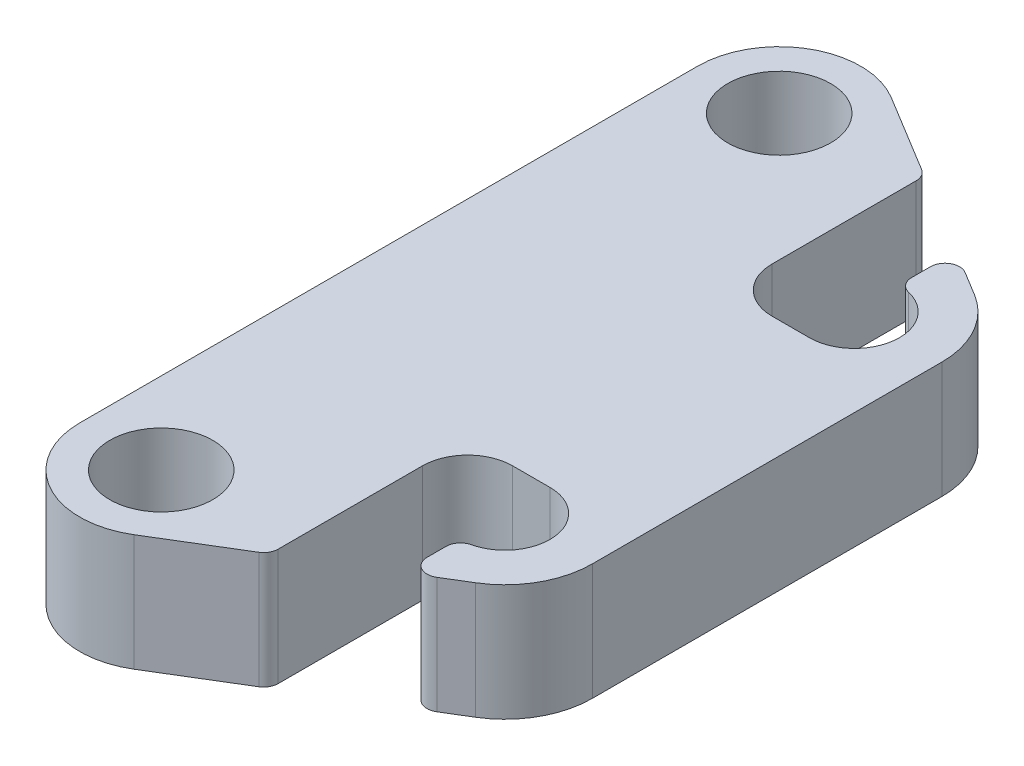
ISO-10303-21;
HEADER;
FILE_DESCRIPTION(('STEP AP214'),'2;1');
FILE_NAME('part.step','',(''),(''),'','','');
FILE_SCHEMA(('AUTOMOTIVE_DESIGN { 1 0 10303 214 1 1 1 1 }'));
ENDSEC;
DATA;
#1=APPLICATION_CONTEXT('core data for automotive mechanical design processes');
#2=APPLICATION_PROTOCOL_DEFINITION('international standard','automotive_design',2000,#1);
#3=PRODUCT_CONTEXT('',#1,'mechanical');
#4=PRODUCT('Part','Part','',(#3));
#5=PRODUCT_RELATED_PRODUCT_CATEGORY('part','',(#4));
#6=PRODUCT_DEFINITION_FORMATION('','',#4);
#7=PRODUCT_DEFINITION_CONTEXT('part definition',#1,'design');
#8=PRODUCT_DEFINITION('design','',#6,#7);
#9=PRODUCT_DEFINITION_SHAPE('','',#8);
#10=(LENGTH_UNIT() NAMED_UNIT(*) SI_UNIT(.MILLI.,.METRE.));
#11=(NAMED_UNIT(*) PLANE_ANGLE_UNIT() SI_UNIT($,.RADIAN.));
#12=(NAMED_UNIT(*) SI_UNIT($,.STERADIAN.) SOLID_ANGLE_UNIT());
#13=UNCERTAINTY_MEASURE_WITH_UNIT(LENGTH_MEASURE(1.E-05),#10,'distance_accuracy_value','');
#14=(GEOMETRIC_REPRESENTATION_CONTEXT(3) GLOBAL_UNCERTAINTY_ASSIGNED_CONTEXT((#13)) GLOBAL_UNIT_ASSIGNED_CONTEXT((#10,
#11,#12)) REPRESENTATION_CONTEXT('',''));
#15=CARTESIAN_POINT('',(0.,0.,0.));
#16=DIRECTION('',(0.,0.,1.));
#17=DIRECTION('',(1.,0.,0.));
#18=AXIS2_PLACEMENT_3D('',#15,#16,#17);
#19=CARTESIAN_POINT('',(2.30969157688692,6.35,-20.6380085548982));
#20=DIRECTION('',(-0.519615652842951,0.,0.854400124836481));
#21=DIRECTION('',(0.854400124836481,0.,0.519615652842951));
#22=AXIS2_PLACEMENT_3D('',#19,#20,#21);
#23=PLANE('',#22);
#24=DIRECTION('',(-0.854400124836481,0.,-0.519615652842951));
#25=VECTOR('',#24,1.);
#26=CARTESIAN_POINT('',(2.30969157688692,6.35,-20.6380085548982));
#27=LINE('',#26,#25);
#28=CARTESIAN_POINT('',(6.54019492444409,6.35,-18.0651674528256));
#29=VERTEX_POINT('',#28);
#30=CARTESIAN_POINT('',(2.30969157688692,6.35,-20.6380085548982));
#31=VERTEX_POINT('',#30);
#32=EDGE_CURVE('E308',#29,#31,#27,.T.);
#33=ORIENTED_EDGE('',*,*,#32,.F.);
#34=DIRECTION('',(0.,1.,0.));
#35=VECTOR('',#34,1.);
#36=CARTESIAN_POINT('',(6.54019492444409,0.,-18.0651674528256));
#37=LINE('',#36,#35);
#38=CARTESIAN_POINT('',(6.54019492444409,0.,-18.0651674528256));
#39=VERTEX_POINT('',#38);
#40=EDGE_CURVE('E11',#29,#39,#37,.F.);
#41=ORIENTED_EDGE('',*,*,#40,.T.);
#42=DIRECTION('',(-0.854400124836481,0.,-0.519615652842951));
#43=VECTOR('',#42,1.);
#44=CARTESIAN_POINT('',(2.30969157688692,0.,-20.6380085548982));
#45=LINE('',#44,#43);
#46=CARTESIAN_POINT('',(2.30969157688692,0.,-20.6380085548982));
#47=VERTEX_POINT('',#46);
#48=EDGE_CURVE('E330',#39,#47,#45,.T.);
#49=ORIENTED_EDGE('',*,*,#48,.T.);
#50=DIRECTION('',(0.,-1.,0.));
#51=VECTOR('',#50,1.);
#52=CARTESIAN_POINT('',(2.30969157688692,6.35,-20.6380085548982));
#53=LINE('',#52,#51);
#54=EDGE_CURVE('E364',#31,#47,#53,.T.);
#55=ORIENTED_EDGE('',*,*,#54,.F.);
#56=EDGE_LOOP('',(#33,#41,#49,#55));
#57=FACE_BOUND('',#56,.T.);
#58=ADVANCED_FACE('F40',(#57),#23,.F.);
#59=CARTESIAN_POINT('',(13.8919695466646,0.,-13.5940805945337));
#60=VERTEX_POINT('',#59);
#61=CARTESIAN_POINT('',(12.5726949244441,0.,-14.396416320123));
#62=VERTEX_POINT('',#61);
#63=EDGE_CURVE('E331',#60,#62,#45,.T.);
#64=ORIENTED_EDGE('',*,*,#63,.T.);
#65=DIRECTION('',(0.,1.,0.));
#66=VECTOR('',#65,1.);
#67=CARTESIAN_POINT('',(12.5726949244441,6.35,-14.396416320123));
#68=LINE('',#67,#66);
#69=CARTESIAN_POINT('',(12.5726949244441,6.35,-14.396416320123));
#70=VERTEX_POINT('',#69);
#71=EDGE_CURVE('E414',#62,#70,#68,.T.);
#72=ORIENTED_EDGE('',*,*,#71,.T.);
#73=CARTESIAN_POINT('',(13.8919695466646,6.35,-13.5940805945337));
#74=VERTEX_POINT('',#73);
#75=EDGE_CURVE('E310',#74,#70,#27,.T.);
#76=ORIENTED_EDGE('',*,*,#75,.F.);
#77=DIRECTION('',(0.,-1.,0.));
#78=VECTOR('',#77,1.);
#79=CARTESIAN_POINT('',(13.8919695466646,6.35,-13.5940805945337));
#80=LINE('',#79,#78);
#81=EDGE_CURVE('E367',#74,#60,#80,.T.);
#82=ORIENTED_EDGE('',*,*,#81,.T.);
#83=EDGE_LOOP('',(#64,#72,#76,#82));
#84=FACE_BOUND('',#83,.T.);
#85=ADVANCED_FACE('F439',(#84),#23,.F.);
#86=CARTESIAN_POINT('',(2.30969157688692,6.35,20.6380085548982));
#87=DIRECTION('',(-0.519615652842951,0.,-0.854400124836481));
#88=DIRECTION('',(-0.854400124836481,0.,0.519615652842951));
#89=AXIS2_PLACEMENT_3D('',#86,#87,#88);
#90=PLANE('',#89);
#91=DIRECTION('',(0.854400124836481,0.,-0.519615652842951));
#92=VECTOR('',#91,1.);
#93=CARTESIAN_POINT('',(2.30969157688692,6.35,20.6380085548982));
#94=LINE('',#93,#92);
#95=CARTESIAN_POINT('',(12.5726949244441,6.35,14.396416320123));
#96=VERTEX_POINT('',#95);
#97=CARTESIAN_POINT('',(13.8919695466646,6.35,13.5940805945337));
#98=VERTEX_POINT('',#97);
#99=EDGE_CURVE('E319',#96,#98,#94,.T.);
#100=ORIENTED_EDGE('',*,*,#99,.F.);
#101=DIRECTION('',(0.,1.,0.));
#102=VECTOR('',#101,1.);
#103=CARTESIAN_POINT('',(12.5726949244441,0.,14.396416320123));
#104=LINE('',#103,#102);
#105=CARTESIAN_POINT('',(12.5726949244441,0.,14.396416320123));
#106=VERTEX_POINT('',#105);
#107=EDGE_CURVE('E403',#96,#106,#104,.F.);
#108=ORIENTED_EDGE('',*,*,#107,.T.);
#109=DIRECTION('',(0.854400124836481,0.,-0.519615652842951));
#110=VECTOR('',#109,1.);
#111=CARTESIAN_POINT('',(2.30969157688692,0.,20.6380085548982));
#112=LINE('',#111,#110);
#113=CARTESIAN_POINT('',(13.8919695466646,0.,13.5940805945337));
#114=VERTEX_POINT('',#113);
#115=EDGE_CURVE('E340',#106,#114,#112,.T.);
#116=ORIENTED_EDGE('',*,*,#115,.T.);
#117=DIRECTION('',(0.,-1.,0.));
#118=VECTOR('',#117,1.);
#119=CARTESIAN_POINT('',(13.8919695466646,6.35,13.5940805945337));
#120=LINE('',#119,#118);
#121=EDGE_CURVE('E352',#98,#114,#120,.T.);
#122=ORIENTED_EDGE('',*,*,#121,.F.);
#123=EDGE_LOOP('',(#100,#108,#116,#122));
#124=FACE_BOUND('',#123,.T.);
#125=ADVANCED_FACE('F528',(#124),#90,.F.);
#126=CARTESIAN_POINT('',(2.30969157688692,0.,20.6380085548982));
#127=VERTEX_POINT('',#126);
#128=CARTESIAN_POINT('',(6.54019492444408,0.,18.0651674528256));
#129=VERTEX_POINT('',#128);
#130=EDGE_CURVE('E341',#127,#129,#112,.T.);
#131=ORIENTED_EDGE('',*,*,#130,.T.);
#132=DIRECTION('',(0.,1.,0.));
#133=VECTOR('',#132,1.);
#134=CARTESIAN_POINT('',(6.54019492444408,6.35,18.0651674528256));
#135=LINE('',#134,#133);
#136=CARTESIAN_POINT('',(6.54019492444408,6.35,18.0651674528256));
#137=VERTEX_POINT('',#136);
#138=EDGE_CURVE('E370',#129,#137,#135,.T.);
#139=ORIENTED_EDGE('',*,*,#138,.T.);
#140=CARTESIAN_POINT('',(2.30969157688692,6.35,20.6380085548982));
#141=VERTEX_POINT('',#140);
#142=EDGE_CURVE('E320',#141,#137,#94,.T.);
#143=ORIENTED_EDGE('',*,*,#142,.F.);
#144=DIRECTION('',(0.,-1.,0.));
#145=VECTOR('',#144,1.);
#146=CARTESIAN_POINT('',(2.30969157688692,6.35,20.6380085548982));
#147=LINE('',#146,#145);
#148=EDGE_CURVE('E355',#141,#127,#147,.T.);
#149=ORIENTED_EDGE('',*,*,#148,.T.);
#150=EDGE_LOOP('',(#131,#139,#143,#149));
#151=FACE_BOUND('',#150,.T.);
#152=ADVANCED_FACE('F499',(#151),#90,.F.);
#153=CARTESIAN_POINT('',(11.4173,6.35,-9.525));
#154=DIRECTION('',(0.,1.,0.));
#155=DIRECTION('',(0.,0.,1.));
#156=AXIS2_PLACEMENT_3D('',#153,#154,#155);
#157=PLANE('',#156);
#158=CARTESIAN_POINT('',(0.,6.35,16.8402));
#159=DIRECTION('',(0.,-1.,0.));
#160=DIRECTION('',(0.,0.,-1.));
#161=AXIS2_PLACEMENT_3D('',#158,#159,#160);
#162=CIRCLE('',#161,2.8067);
#163=CARTESIAN_POINT('',(0.,6.35,14.0335));
#164=VERTEX_POINT('',#163);
#165=EDGE_CURVE('E295',#164,#164,#162,.T.);
#166=ORIENTED_EDGE('',*,*,#165,.T.);
#167=EDGE_LOOP('',(#166));
#168=FACE_BOUND('',#167,.T.);
#169=CARTESIAN_POINT('',(0.,6.35,-16.8402));
#170=DIRECTION('',(0.,-1.,0.));
#171=DIRECTION('',(0.,0.,-1.));
#172=AXIS2_PLACEMENT_3D('',#169,#170,#171);
#173=CIRCLE('',#172,2.8067);
#174=CARTESIAN_POINT('',(0.,6.35,-19.6469));
#175=VERTEX_POINT('',#174);
#176=EDGE_CURVE('E301',#175,#175,#173,.T.);
#177=ORIENTED_EDGE('',*,*,#176,.T.);
#178=EDGE_LOOP('',(#177));
#179=FACE_BOUND('',#178,.T.);
#180=ORIENTED_EDGE('',*,*,#142,.T.);
#181=CARTESIAN_POINT('',(6.12774999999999,6.35,17.3869873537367));
#182=DIRECTION('',(0.,1.,0.));
#183=DIRECTION('',(0.,0.,1.));
#184=AXIS2_PLACEMENT_3D('',#181,#182,#183);
#185=CIRCLE('',#184,0.79375);
#186=CARTESIAN_POINT('',(6.92149999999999,6.35,17.3869873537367));
#187=VERTEX_POINT('',#186);
#188=EDGE_CURVE('E383',#137,#187,#185,.T.);
#189=ORIENTED_EDGE('',*,*,#188,.T.);
#190=DIRECTION('',(0.,0.,-1.));
#191=VECTOR('',#190,1.);
#192=CARTESIAN_POINT('',(6.92149999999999,6.35,9.525));
#193=LINE('',#192,#191);
#194=CARTESIAN_POINT('',(6.92149999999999,6.35,9.525));
#195=VERTEX_POINT('',#194);
#196=EDGE_CURVE('E271',#187,#195,#193,.T.);
#197=ORIENTED_EDGE('',*,*,#196,.T.);
#198=CARTESIAN_POINT('',(9.37894999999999,6.35,9.525));
#199=DIRECTION('',(0.,-1.,0.));
#200=DIRECTION('',(0.,0.,1.));
#201=AXIS2_PLACEMENT_3D('',#198,#199,#200);
#202=CIRCLE('',#201,2.45745);
#203=CARTESIAN_POINT('',(9.37894999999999,6.35,7.06755));
#204=VERTEX_POINT('',#203);
#205=EDGE_CURVE('E273',#195,#204,#202,.T.);
#206=ORIENTED_EDGE('',*,*,#205,.T.);
#207=DIRECTION('',(1.,0.,0.));
#208=VECTOR('',#207,1.);
#209=CARTESIAN_POINT('',(11.4173,6.35,7.06755));
#210=LINE('',#209,#208);
#211=CARTESIAN_POINT('',(11.4173,6.35,7.06755));
#212=VERTEX_POINT('',#211);
#213=EDGE_CURVE('E261',#204,#212,#210,.T.);
#214=ORIENTED_EDGE('',*,*,#213,.T.);
#215=CARTESIAN_POINT('',(11.4173,6.35,9.525));
#216=DIRECTION('',(0.,-1.,0.));
#217=DIRECTION('',(0.,0.,-1.));
#218=AXIS2_PLACEMENT_3D('',#215,#216,#217);
#219=CIRCLE('',#218,2.45745);
#220=CARTESIAN_POINT('',(11.9788657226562,6.35,11.9174264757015));
#221=VERTEX_POINT('',#220);
#222=EDGE_CURVE('E285',#212,#221,#219,.T.);
#223=ORIENTED_EDGE('',*,*,#222,.T.);
#224=CARTESIAN_POINT('',(12.16025,6.35,12.6901740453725));
#225=DIRECTION('',(0.,1.,0.));
#226=DIRECTION('',(0.,0.,1.));
#227=AXIS2_PLACEMENT_3D('',#224,#225,#226);
#228=CIRCLE('',#227,0.79375);
#229=CARTESIAN_POINT('',(11.3665,6.35,12.6901740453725));
#230=VERTEX_POINT('',#229);
#231=EDGE_CURVE('E379',#221,#230,#228,.T.);
#232=ORIENTED_EDGE('',*,*,#231,.T.);
#233=DIRECTION('',(0.,0.,1.));
#234=VECTOR('',#233,1.);
#235=CARTESIAN_POINT('',(11.3665,6.35,11.98245));
#236=LINE('',#235,#234);
#237=CARTESIAN_POINT('',(11.3665,6.35,13.718236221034));
#238=VERTEX_POINT('',#237);
#239=EDGE_CURVE('E268',#230,#238,#236,.T.);
#240=ORIENTED_EDGE('',*,*,#239,.T.);
#241=CARTESIAN_POINT('',(12.16025,6.35,13.718236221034));
#242=DIRECTION('',(0.,1.,0.));
#243=DIRECTION('',(0.,0.,1.));
#244=AXIS2_PLACEMENT_3D('',#241,#242,#243);
#245=CIRCLE('',#244,0.79375);
#246=EDGE_CURVE('E381',#238,#96,#245,.T.);
#247=ORIENTED_EDGE('',*,*,#246,.T.);
#248=ORIENTED_EDGE('',*,*,#99,.T.);
#249=CARTESIAN_POINT('',(11.4173,6.35,9.525));
#250=DIRECTION('',(0.,1.,0.));
#251=DIRECTION('',(0.,0.,-1.));
#252=AXIS2_PLACEMENT_3D('',#249,#250,#251);
#253=CIRCLE('',#252,4.7625);
#254=CARTESIAN_POINT('',(16.1798,6.35,9.525));
#255=VERTEX_POINT('',#254);
#256=EDGE_CURVE('E323',#98,#255,#253,.T.);
#257=ORIENTED_EDGE('',*,*,#256,.T.);
#258=DIRECTION('',(0.,0.,-1.));
#259=VECTOR('',#258,1.);
#260=CARTESIAN_POINT('',(16.1798,6.35,-9.525));
#261=LINE('',#260,#259);
#262=CARTESIAN_POINT('',(16.1798,6.35,-9.525));
#263=VERTEX_POINT('',#262);
#264=EDGE_CURVE('E325',#255,#263,#261,.T.);
#265=ORIENTED_EDGE('',*,*,#264,.T.);
#266=CARTESIAN_POINT('',(11.4173,6.35,-9.525));
#267=DIRECTION('',(0.,1.,0.));
#268=DIRECTION('',(0.,0.,1.));
#269=AXIS2_PLACEMENT_3D('',#266,#267,#268);
#270=CIRCLE('',#269,4.7625);
#271=EDGE_CURVE('E305',#263,#74,#270,.T.);
#272=ORIENTED_EDGE('',*,*,#271,.T.);
#273=ORIENTED_EDGE('',*,*,#75,.T.);
#274=CARTESIAN_POINT('',(12.16025,6.35,-13.718236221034));
#275=DIRECTION('',(0.,1.,0.));
#276=DIRECTION('',(0.,0.,1.));
#277=AXIS2_PLACEMENT_3D('',#274,#275,#276);
#278=CIRCLE('',#277,0.79375);
#279=CARTESIAN_POINT('',(11.3665,6.35,-13.718236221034));
#280=VERTEX_POINT('',#279);
#281=EDGE_CURVE('E375',#70,#280,#278,.T.);
#282=ORIENTED_EDGE('',*,*,#281,.T.);
#283=DIRECTION('',(0.,0.,1.));
#284=VECTOR('',#283,1.);
#285=CARTESIAN_POINT('',(11.3665,6.35,-11.98245));
#286=LINE('',#285,#284);
#287=CARTESIAN_POINT('',(11.3665,6.35,-12.6901740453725));
#288=VERTEX_POINT('',#287);
#289=EDGE_CURVE('E249',#280,#288,#286,.T.);
#290=ORIENTED_EDGE('',*,*,#289,.T.);
#291=CARTESIAN_POINT('',(12.16025,6.35,-12.6901740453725));
#292=DIRECTION('',(0.,1.,0.));
#293=DIRECTION('',(0.,0.,1.));
#294=AXIS2_PLACEMENT_3D('',#291,#292,#293);
#295=CIRCLE('',#294,0.79375);
#296=CARTESIAN_POINT('',(11.9788657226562,6.35,-11.9174264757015));
#297=VERTEX_POINT('',#296);
#298=EDGE_CURVE('E377',#288,#297,#295,.T.);
#299=ORIENTED_EDGE('',*,*,#298,.T.);
#300=CARTESIAN_POINT('',(11.4173,6.35,-9.525));
#301=DIRECTION('',(0.,-1.,0.));
#302=DIRECTION('',(0.,0.,-1.));
#303=AXIS2_PLACEMENT_3D('',#300,#301,#302);
#304=CIRCLE('',#303,2.45745);
#305=CARTESIAN_POINT('',(11.4173,6.35,-7.06755));
#306=VERTEX_POINT('',#305);
#307=EDGE_CURVE('E290',#297,#306,#304,.T.);
#308=ORIENTED_EDGE('',*,*,#307,.T.);
#309=DIRECTION('',(-1.,0.,0.));
#310=VECTOR('',#309,1.);
#311=CARTESIAN_POINT('',(11.4173,6.35,-7.06755));
#312=LINE('',#311,#310);
#313=CARTESIAN_POINT('',(9.37894999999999,6.35,-7.06755));
#314=VERTEX_POINT('',#313);
#315=EDGE_CURVE('E225',#306,#314,#312,.T.);
#316=ORIENTED_EDGE('',*,*,#315,.T.);
#317=CARTESIAN_POINT('',(9.37894999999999,6.35,-9.525));
#318=DIRECTION('',(0.,-1.,0.));
#319=DIRECTION('',(0.,0.,-1.));
#320=AXIS2_PLACEMENT_3D('',#317,#318,#319);
#321=CIRCLE('',#320,2.45745);
#322=CARTESIAN_POINT('',(6.92149999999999,6.35,-9.525));
#323=VERTEX_POINT('',#322);
#324=EDGE_CURVE('E245',#314,#323,#321,.T.);
#325=ORIENTED_EDGE('',*,*,#324,.T.);
#326=DIRECTION('',(0.,0.,-1.));
#327=VECTOR('',#326,1.);
#328=CARTESIAN_POINT('',(6.92149999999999,6.35,-9.525));
#329=LINE('',#328,#327);
#330=CARTESIAN_POINT('',(6.92149999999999,6.35,-17.3869873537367));
#331=VERTEX_POINT('',#330);
#332=EDGE_CURVE('E232',#323,#331,#329,.T.);
#333=ORIENTED_EDGE('',*,*,#332,.T.);
#334=CARTESIAN_POINT('',(6.12774999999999,6.35,-17.3869873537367));
#335=DIRECTION('',(0.,1.,0.));
#336=DIRECTION('',(0.,0.,1.));
#337=AXIS2_PLACEMENT_3D('',#334,#335,#336);
#338=CIRCLE('',#337,0.79375);
#339=EDGE_CURVE('E373',#331,#29,#338,.T.);
#340=ORIENTED_EDGE('',*,*,#339,.T.);
#341=ORIENTED_EDGE('',*,*,#32,.T.);
#342=CARTESIAN_POINT('',(0.,6.35,-16.8402));
#343=DIRECTION('',(0.,1.,0.));
#344=DIRECTION('',(0.,0.,1.));
#345=AXIS2_PLACEMENT_3D('',#342,#343,#344);
#346=CIRCLE('',#345,4.445);
#347=CARTESIAN_POINT('',(-4.445,6.35,-16.8402));
#348=VERTEX_POINT('',#347);
#349=EDGE_CURVE('E313',#31,#348,#346,.T.);
#350=ORIENTED_EDGE('',*,*,#349,.T.);
#351=DIRECTION('',(0.,0.,1.));
#352=VECTOR('',#351,1.);
#353=CARTESIAN_POINT('',(-4.445,6.35,-16.8402));
#354=LINE('',#353,#352);
#355=CARTESIAN_POINT('',(-4.445,6.35,16.8402));
#356=VERTEX_POINT('',#355);
#357=EDGE_CURVE('E315',#348,#356,#354,.T.);
#358=ORIENTED_EDGE('',*,*,#357,.T.);
#359=CARTESIAN_POINT('',(0.,6.35,16.8402));
#360=DIRECTION('',(0.,1.,0.));
#361=DIRECTION('',(0.,0.,-1.));
#362=AXIS2_PLACEMENT_3D('',#359,#360,#361);
#363=CIRCLE('',#362,4.445);
#364=EDGE_CURVE('E317',#356,#141,#363,.T.);
#365=ORIENTED_EDGE('',*,*,#364,.T.);
#366=EDGE_LOOP('',(#180,#189,#197,#206,#214,#223,#232,#240,#247,#248,#257,#265,#272,#273,#282,
#290,#299,#308,#316,#325,#333,#340,#341,#350,#358,#365));
#367=FACE_BOUND('',#366,.T.);
#368=ADVANCED_FACE('F418',(#168,#179,#367),#157,.T.);
#369=CARTESIAN_POINT('',(11.4173,0.,-9.525));
#370=DIRECTION('',(0.,1.,0.));
#371=DIRECTION('',(0.,0.,1.));
#372=AXIS2_PLACEMENT_3D('',#369,#370,#371);
#373=PLANE('',#372);
#374=CARTESIAN_POINT('',(0.,0.,16.8402));
#375=DIRECTION('',(0.,-1.,0.));
#376=DIRECTION('',(0.,0.,-1.));
#377=AXIS2_PLACEMENT_3D('',#374,#375,#376);
#378=CIRCLE('',#377,2.8067);
#379=CARTESIAN_POINT('',(0.,0.,14.0335));
#380=VERTEX_POINT('',#379);
#381=EDGE_CURVE('E292',#380,#380,#378,.T.);
#382=ORIENTED_EDGE('',*,*,#381,.F.);
#383=EDGE_LOOP('',(#382));
#384=FACE_BOUND('',#383,.T.);
#385=CARTESIAN_POINT('',(0.,0.,-16.8402));
#386=DIRECTION('',(0.,-1.,0.));
#387=DIRECTION('',(0.,0.,-1.));
#388=AXIS2_PLACEMENT_3D('',#385,#386,#387);
#389=CIRCLE('',#388,2.8067);
#390=CARTESIAN_POINT('',(0.,0.,-19.6469));
#391=VERTEX_POINT('',#390);
#392=EDGE_CURVE('E298',#391,#391,#389,.T.);
#393=ORIENTED_EDGE('',*,*,#392,.F.);
#394=EDGE_LOOP('',(#393));
#395=FACE_BOUND('',#394,.T.);
#396=DIRECTION('',(0.,0.,-1.));
#397=VECTOR('',#396,1.);
#398=CARTESIAN_POINT('',(6.92149999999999,0.,9.525));
#399=LINE('',#398,#397);
#400=CARTESIAN_POINT('',(6.92149999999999,0.,17.3869873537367));
#401=VERTEX_POINT('',#400);
#402=CARTESIAN_POINT('',(6.92149999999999,0.,9.525));
#403=VERTEX_POINT('',#402);
#404=EDGE_CURVE('E260',#401,#403,#399,.T.);
#405=ORIENTED_EDGE('',*,*,#404,.F.);
#406=CARTESIAN_POINT('',(6.12774999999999,0.,17.3869873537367));
#407=DIRECTION('',(0.,1.,0.));
#408=DIRECTION('',(0.,0.,1.));
#409=AXIS2_PLACEMENT_3D('',#406,#407,#408);
#410=CIRCLE('',#409,0.79375);
#411=EDGE_CURVE('E396',#401,#129,#410,.F.);
#412=ORIENTED_EDGE('',*,*,#411,.T.);
#413=ORIENTED_EDGE('',*,*,#130,.F.);
#414=CARTESIAN_POINT('',(0.,0.,16.8402));
#415=DIRECTION('',(0.,1.,0.));
#416=DIRECTION('',(0.,0.,-1.));
#417=AXIS2_PLACEMENT_3D('',#414,#415,#416);
#418=CIRCLE('',#417,4.445);
#419=CARTESIAN_POINT('',(-4.445,0.,16.8402));
#420=VERTEX_POINT('',#419);
#421=EDGE_CURVE('E338',#420,#127,#418,.T.);
#422=ORIENTED_EDGE('',*,*,#421,.F.);
#423=DIRECTION('',(0.,0.,1.));
#424=VECTOR('',#423,1.);
#425=CARTESIAN_POINT('',(-4.445,0.,-16.8402));
#426=LINE('',#425,#424);
#427=CARTESIAN_POINT('',(-4.445,0.,-16.8402));
#428=VERTEX_POINT('',#427);
#429=EDGE_CURVE('E336',#428,#420,#426,.T.);
#430=ORIENTED_EDGE('',*,*,#429,.F.);
#431=CARTESIAN_POINT('',(0.,0.,-16.8402));
#432=DIRECTION('',(0.,1.,0.));
#433=DIRECTION('',(0.,0.,1.));
#434=AXIS2_PLACEMENT_3D('',#431,#432,#433);
#435=CIRCLE('',#434,4.445);
#436=EDGE_CURVE('E334',#47,#428,#435,.T.);
#437=ORIENTED_EDGE('',*,*,#436,.F.);
#438=ORIENTED_EDGE('',*,*,#48,.F.);
#439=CARTESIAN_POINT('',(6.12774999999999,0.,-17.3869873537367));
#440=DIRECTION('',(0.,1.,0.));
#441=DIRECTION('',(0.,0.,1.));
#442=AXIS2_PLACEMENT_3D('',#439,#440,#441);
#443=CIRCLE('',#442,0.79375);
#444=CARTESIAN_POINT('',(6.92149999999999,0.,-17.3869873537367));
#445=VERTEX_POINT('',#444);
#446=EDGE_CURVE('E63',#39,#445,#443,.F.);
#447=ORIENTED_EDGE('',*,*,#446,.T.);
#448=DIRECTION('',(0.,0.,-1.));
#449=VECTOR('',#448,1.);
#450=CARTESIAN_POINT('',(6.92149999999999,0.,-9.525));
#451=LINE('',#450,#449);
#452=CARTESIAN_POINT('',(6.92149999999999,0.,-9.525));
#453=VERTEX_POINT('',#452);
#454=EDGE_CURVE('E224',#453,#445,#451,.T.);
#455=ORIENTED_EDGE('',*,*,#454,.F.);
#456=CARTESIAN_POINT('',(9.37894999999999,0.,-9.525));
#457=DIRECTION('',(0.,-1.,0.));
#458=DIRECTION('',(0.,0.,-1.));
#459=AXIS2_PLACEMENT_3D('',#456,#457,#458);
#460=CIRCLE('',#459,2.45745);
#461=CARTESIAN_POINT('',(9.37894999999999,0.,-7.06755));
#462=VERTEX_POINT('',#461);
#463=EDGE_CURVE('E216',#462,#453,#460,.T.);
#464=ORIENTED_EDGE('',*,*,#463,.F.);
#465=DIRECTION('',(-1.,0.,0.));
#466=VECTOR('',#465,1.);
#467=CARTESIAN_POINT('',(11.4173,0.,-7.06755));
#468=LINE('',#467,#466);
#469=CARTESIAN_POINT('',(11.4173,0.,-7.06755));
#470=VERTEX_POINT('',#469);
#471=EDGE_CURVE('E241',#470,#462,#468,.T.);
#472=ORIENTED_EDGE('',*,*,#471,.F.);
#473=CARTESIAN_POINT('',(11.4173,0.,-9.525));
#474=DIRECTION('',(0.,-1.,0.));
#475=DIRECTION('',(0.,0.,-1.));
#476=AXIS2_PLACEMENT_3D('',#473,#474,#475);
#477=CIRCLE('',#476,2.45745);
#478=CARTESIAN_POINT('',(11.9788657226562,0.,-11.9174264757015));
#479=VERTEX_POINT('',#478);
#480=EDGE_CURVE('E288',#479,#470,#477,.T.);
#481=ORIENTED_EDGE('',*,*,#480,.F.);
#482=CARTESIAN_POINT('',(12.16025,0.,-12.6901740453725));
#483=DIRECTION('',(0.,1.,0.));
#484=DIRECTION('',(0.,0.,1.));
#485=AXIS2_PLACEMENT_3D('',#482,#483,#484);
#486=CIRCLE('',#485,0.79375);
#487=CARTESIAN_POINT('',(11.3665,0.,-12.6901740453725));
#488=VERTEX_POINT('',#487);
#489=EDGE_CURVE('E390',#479,#488,#486,.F.);
#490=ORIENTED_EDGE('',*,*,#489,.T.);
#491=DIRECTION('',(0.,0.,1.));
#492=VECTOR('',#491,1.);
#493=CARTESIAN_POINT('',(11.3665,0.,-11.98245));
#494=LINE('',#493,#492);
#495=CARTESIAN_POINT('',(11.3665,0.,-13.718236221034));
#496=VERTEX_POINT('',#495);
#497=EDGE_CURVE('E238',#496,#488,#494,.T.);
#498=ORIENTED_EDGE('',*,*,#497,.F.);
#499=CARTESIAN_POINT('',(12.16025,0.,-13.718236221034));
#500=DIRECTION('',(0.,1.,0.));
#501=DIRECTION('',(0.,0.,1.));
#502=AXIS2_PLACEMENT_3D('',#499,#500,#501);
#503=CIRCLE('',#502,0.79375);
#504=EDGE_CURVE('E388',#496,#62,#503,.F.);
#505=ORIENTED_EDGE('',*,*,#504,.T.);
#506=ORIENTED_EDGE('',*,*,#63,.F.);
#507=CARTESIAN_POINT('',(11.4173,0.,-9.525));
#508=DIRECTION('',(0.,1.,0.));
#509=DIRECTION('',(0.,0.,1.));
#510=AXIS2_PLACEMENT_3D('',#507,#508,#509);
#511=CIRCLE('',#510,4.7625);
#512=CARTESIAN_POINT('',(16.1798,0.,-9.525));
#513=VERTEX_POINT('',#512);
#514=EDGE_CURVE('E304',#513,#60,#511,.T.);
#515=ORIENTED_EDGE('',*,*,#514,.F.);
#516=DIRECTION('',(0.,0.,-1.));
#517=VECTOR('',#516,1.);
#518=CARTESIAN_POINT('',(16.1798,0.,-9.525));
#519=LINE('',#518,#517);
#520=CARTESIAN_POINT('',(16.1798,0.,9.525));
#521=VERTEX_POINT('',#520);
#522=EDGE_CURVE('E309',#521,#513,#519,.T.);
#523=ORIENTED_EDGE('',*,*,#522,.F.);
#524=CARTESIAN_POINT('',(11.4173,0.,9.525));
#525=DIRECTION('',(0.,1.,0.));
#526=DIRECTION('',(0.,0.,-1.));
#527=AXIS2_PLACEMENT_3D('',#524,#525,#526);
#528=CIRCLE('',#527,4.7625);
#529=EDGE_CURVE('E344',#114,#521,#528,.T.);
#530=ORIENTED_EDGE('',*,*,#529,.F.);
#531=ORIENTED_EDGE('',*,*,#115,.F.);
#532=CARTESIAN_POINT('',(12.16025,0.,13.718236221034));
#533=DIRECTION('',(0.,1.,0.));
#534=DIRECTION('',(0.,0.,1.));
#535=AXIS2_PLACEMENT_3D('',#532,#533,#534);
#536=CIRCLE('',#535,0.79375);
#537=CARTESIAN_POINT('',(11.3665,0.,13.718236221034));
#538=VERTEX_POINT('',#537);
#539=EDGE_CURVE('E394',#106,#538,#536,.F.);
#540=ORIENTED_EDGE('',*,*,#539,.T.);
#541=DIRECTION('',(0.,0.,1.));
#542=VECTOR('',#541,1.);
#543=CARTESIAN_POINT('',(11.3665,0.,11.98245));
#544=LINE('',#543,#542);
#545=CARTESIAN_POINT('',(11.3665,0.,12.6901740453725));
#546=VERTEX_POINT('',#545);
#547=EDGE_CURVE('E257',#546,#538,#544,.T.);
#548=ORIENTED_EDGE('',*,*,#547,.F.);
#549=CARTESIAN_POINT('',(12.16025,0.,12.6901740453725));
#550=DIRECTION('',(0.,1.,0.));
#551=DIRECTION('',(0.,0.,1.));
#552=AXIS2_PLACEMENT_3D('',#549,#550,#551);
#553=CIRCLE('',#552,0.79375);
#554=CARTESIAN_POINT('',(11.9788657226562,0.,11.9174264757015));
#555=VERTEX_POINT('',#554);
#556=EDGE_CURVE('E392',#546,#555,#553,.F.);
#557=ORIENTED_EDGE('',*,*,#556,.T.);
#558=CARTESIAN_POINT('',(11.4173,0.,9.525));
#559=DIRECTION('',(0.,-1.,0.));
#560=DIRECTION('',(0.,0.,-1.));
#561=AXIS2_PLACEMENT_3D('',#558,#559,#560);
#562=CIRCLE('',#561,2.45745);
#563=CARTESIAN_POINT('',(11.4173,0.,7.06755));
#564=VERTEX_POINT('',#563);
#565=EDGE_CURVE('E233',#564,#555,#562,.T.);
#566=ORIENTED_EDGE('',*,*,#565,.F.);
#567=DIRECTION('',(1.,0.,0.));
#568=VECTOR('',#567,1.);
#569=CARTESIAN_POINT('',(11.4173,0.,7.06755));
#570=LINE('',#569,#568);
#571=CARTESIAN_POINT('',(9.37894999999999,0.,7.06755));
#572=VERTEX_POINT('',#571);
#573=EDGE_CURVE('E265',#572,#564,#570,.T.);
#574=ORIENTED_EDGE('',*,*,#573,.F.);
#575=CARTESIAN_POINT('',(9.37894999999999,0.,9.525));
#576=DIRECTION('',(0.,-1.,0.));
#577=DIRECTION('',(0.,0.,1.));
#578=AXIS2_PLACEMENT_3D('',#575,#576,#577);
#579=CIRCLE('',#578,2.45745);
#580=EDGE_CURVE('E263',#403,#572,#579,.T.);
#581=ORIENTED_EDGE('',*,*,#580,.F.);
#582=EDGE_LOOP('',(#405,#412,#413,#422,#430,#437,#438,#447,#455,#464,#472,#481,#490,#498,#505,
#506,#515,#523,#530,#531,#540,#548,#557,#566,#574,#581));
#583=FACE_BOUND('',#582,.T.);
#584=ADVANCED_FACE('F237',(#384,#395,#583),#373,.F.);
#585=CARTESIAN_POINT('',(11.4173,0.,-9.525));
#586=DIRECTION('',(0.,-1.,0.));
#587=DIRECTION('',(0.,0.,-1.));
#588=AXIS2_PLACEMENT_3D('',#585,#586,#587);
#589=CYLINDRICAL_SURFACE('',#588,2.45745);
#590=ORIENTED_EDGE('',*,*,#307,.F.);
#591=DIRECTION('',(0.,-1.,0.));
#592=VECTOR('',#591,1.);
#593=CARTESIAN_POINT('',(11.9788657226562,0.,-11.9174264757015));
#594=LINE('',#593,#592);
#595=EDGE_CURVE('E55',#297,#479,#594,.T.);
#596=ORIENTED_EDGE('',*,*,#595,.T.);
#597=ORIENTED_EDGE('',*,*,#480,.T.);
#598=DIRECTION('',(0.,1.,0.));
#599=VECTOR('',#598,1.);
#600=CARTESIAN_POINT('',(11.4173,0.,-7.06755));
#601=LINE('',#600,#599);
#602=EDGE_CURVE('E234',#470,#306,#601,.T.);
#603=ORIENTED_EDGE('',*,*,#602,.T.);
#604=EDGE_LOOP('',(#590,#596,#597,#603));
#605=FACE_BOUND('',#604,.T.);
#606=ADVANCED_FACE('F424',(#605),#589,.F.);
#607=CARTESIAN_POINT('',(11.4173,6.35,-9.525));
#608=DIRECTION('',(0.,-1.,0.));
#609=DIRECTION('',(0.,0.,-1.));
#610=AXIS2_PLACEMENT_3D('',#607,#608,#609);
#611=CYLINDRICAL_SURFACE('',#610,4.7625);
#612=ORIENTED_EDGE('',*,*,#514,.T.);
#613=ORIENTED_EDGE('',*,*,#81,.F.);
#614=ORIENTED_EDGE('',*,*,#271,.F.);
#615=DIRECTION('',(0.,-1.,0.));
#616=VECTOR('',#615,1.);
#617=CARTESIAN_POINT('',(16.1798,6.35,-9.525));
#618=LINE('',#617,#616);
#619=EDGE_CURVE('E327',#263,#513,#618,.T.);
#620=ORIENTED_EDGE('',*,*,#619,.T.);
#621=EDGE_LOOP('',(#612,#613,#614,#620));
#622=FACE_BOUND('',#621,.T.);
#623=ADVANCED_FACE('F445',(#622),#611,.T.);
#624=CARTESIAN_POINT('',(0.,6.35,-16.8402));
#625=DIRECTION('',(0.,-1.,0.));
#626=DIRECTION('',(0.,0.,-1.));
#627=AXIS2_PLACEMENT_3D('',#624,#625,#626);
#628=CYLINDRICAL_SURFACE('',#627,4.445);
#629=ORIENTED_EDGE('',*,*,#436,.T.);
#630=DIRECTION('',(0.,-1.,0.));
#631=VECTOR('',#630,1.);
#632=CARTESIAN_POINT('',(-4.445,6.35,-16.8402));
#633=LINE('',#632,#631);
#634=EDGE_CURVE('E361',#348,#428,#633,.T.);
#635=ORIENTED_EDGE('',*,*,#634,.F.);
#636=ORIENTED_EDGE('',*,*,#349,.F.);
#637=ORIENTED_EDGE('',*,*,#54,.T.);
#638=EDGE_LOOP('',(#629,#635,#636,#637));
#639=FACE_BOUND('',#638,.T.);
#640=ADVANCED_FACE('F514',(#639),#628,.T.);
#641=CARTESIAN_POINT('',(-4.445,6.35,-16.8402));
#642=DIRECTION('',(1.,0.,0.));
#643=DIRECTION('',(0.,0.,-1.));
#644=AXIS2_PLACEMENT_3D('',#641,#642,#643);
#645=PLANE('',#644);
#646=ORIENTED_EDGE('',*,*,#429,.T.);
#647=DIRECTION('',(0.,-1.,0.));
#648=VECTOR('',#647,1.);
#649=CARTESIAN_POINT('',(-4.445,6.35,16.8402));
#650=LINE('',#649,#648);
#651=EDGE_CURVE('E358',#356,#420,#650,.T.);
#652=ORIENTED_EDGE('',*,*,#651,.F.);
#653=ORIENTED_EDGE('',*,*,#357,.F.);
#654=ORIENTED_EDGE('',*,*,#634,.T.);
#655=EDGE_LOOP('',(#646,#652,#653,#654));
#656=FACE_BOUND('',#655,.T.);
#657=ADVANCED_FACE('F510',(#656),#645,.F.);
#658=CARTESIAN_POINT('',(0.,6.35,16.8402));
#659=DIRECTION('',(0.,-1.,0.));
#660=DIRECTION('',(0.,0.,-1.));
#661=AXIS2_PLACEMENT_3D('',#658,#659,#660);
#662=CYLINDRICAL_SURFACE('',#661,4.445);
#663=ORIENTED_EDGE('',*,*,#421,.T.);
#664=ORIENTED_EDGE('',*,*,#148,.F.);
#665=ORIENTED_EDGE('',*,*,#364,.F.);
#666=ORIENTED_EDGE('',*,*,#651,.T.);
#667=EDGE_LOOP('',(#663,#664,#665,#666));
#668=FACE_BOUND('',#667,.T.);
#669=ADVANCED_FACE('F505',(#668),#662,.T.);
#670=CARTESIAN_POINT('',(11.4173,6.35,9.525));
#671=DIRECTION('',(0.,-1.,0.));
#672=DIRECTION('',(0.,0.,-1.));
#673=AXIS2_PLACEMENT_3D('',#670,#671,#672);
#674=CYLINDRICAL_SURFACE('',#673,4.7625);
#675=ORIENTED_EDGE('',*,*,#529,.T.);
#676=DIRECTION('',(0.,-1.,0.));
#677=VECTOR('',#676,1.);
#678=CARTESIAN_POINT('',(16.1798,6.35,9.525));
#679=LINE('',#678,#677);
#680=EDGE_CURVE('E349',#255,#521,#679,.T.);
#681=ORIENTED_EDGE('',*,*,#680,.F.);
#682=ORIENTED_EDGE('',*,*,#256,.F.);
#683=ORIENTED_EDGE('',*,*,#121,.T.);
#684=EDGE_LOOP('',(#675,#681,#682,#683));
#685=FACE_BOUND('',#684,.T.);
#686=ADVANCED_FACE('F454',(#685),#674,.T.);
#687=CARTESIAN_POINT('',(16.1798,6.35,-9.525));
#688=DIRECTION('',(-1.,0.,0.));
#689=DIRECTION('',(0.,0.,1.));
#690=AXIS2_PLACEMENT_3D('',#687,#688,#689);
#691=PLANE('',#690);
#692=ORIENTED_EDGE('',*,*,#522,.T.);
#693=ORIENTED_EDGE('',*,*,#619,.F.);
#694=ORIENTED_EDGE('',*,*,#264,.F.);
#695=ORIENTED_EDGE('',*,*,#680,.T.);
#696=EDGE_LOOP('',(#692,#693,#694,#695));
#697=FACE_BOUND('',#696,.T.);
#698=ADVANCED_FACE('F450',(#697),#691,.F.);
#699=CARTESIAN_POINT('',(0.,0.,-16.8402));
#700=DIRECTION('',(0.,-1.,0.));
#701=DIRECTION('',(0.,0.,-1.));
#702=AXIS2_PLACEMENT_3D('',#699,#700,#701);
#703=CYLINDRICAL_SURFACE('',#702,2.8067);
#704=ORIENTED_EDGE('',*,*,#176,.F.);
#705=EDGE_LOOP('',(#704));
#706=FACE_BOUND('',#705,.T.);
#707=ORIENTED_EDGE('',*,*,#392,.T.);
#708=EDGE_LOOP('',(#707));
#709=FACE_BOUND('',#708,.T.);
#710=ADVANCED_FACE('F691',(#706,#709),#703,.F.);
#711=CARTESIAN_POINT('',(0.,0.,16.8402));
#712=DIRECTION('',(0.,-1.,0.));
#713=DIRECTION('',(0.,0.,-1.));
#714=AXIS2_PLACEMENT_3D('',#711,#712,#713);
#715=CYLINDRICAL_SURFACE('',#714,2.8067);
#716=ORIENTED_EDGE('',*,*,#165,.F.);
#717=EDGE_LOOP('',(#716));
#718=FACE_BOUND('',#717,.T.);
#719=ORIENTED_EDGE('',*,*,#381,.T.);
#720=EDGE_LOOP('',(#719));
#721=FACE_BOUND('',#720,.T.);
#722=ADVANCED_FACE('F684',(#718,#721),#715,.F.);
#723=CARTESIAN_POINT('',(11.4173,0.,9.525));
#724=DIRECTION('',(0.,-1.,0.));
#725=DIRECTION('',(0.,0.,-1.));
#726=AXIS2_PLACEMENT_3D('',#723,#724,#725);
#727=CYLINDRICAL_SURFACE('',#726,2.45745);
#728=ORIENTED_EDGE('',*,*,#565,.T.);
#729=DIRECTION('',(0.,-1.,0.));
#730=VECTOR('',#729,1.);
#731=CARTESIAN_POINT('',(11.9788657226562,0.,11.9174264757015));
#732=LINE('',#731,#730);
#733=EDGE_CURVE('E405',#555,#221,#732,.F.);
#734=ORIENTED_EDGE('',*,*,#733,.T.);
#735=ORIENTED_EDGE('',*,*,#222,.F.);
#736=DIRECTION('',(0.,1.,0.));
#737=VECTOR('',#736,1.);
#738=CARTESIAN_POINT('',(11.4173,0.,7.06755));
#739=LINE('',#738,#737);
#740=EDGE_CURVE('E267',#564,#212,#739,.T.);
#741=ORIENTED_EDGE('',*,*,#740,.F.);
#742=EDGE_LOOP('',(#728,#734,#735,#741));
#743=FACE_BOUND('',#742,.T.);
#744=ADVANCED_FACE('F475',(#743),#727,.F.);
#745=CARTESIAN_POINT('',(11.4173,0.,7.06755));
#746=DIRECTION('',(0.,0.,1.));
#747=DIRECTION('',(1.,0.,0.));
#748=AXIS2_PLACEMENT_3D('',#745,#746,#747);
#749=PLANE('',#748);
#750=ORIENTED_EDGE('',*,*,#213,.F.);
#751=DIRECTION('',(0.,1.,0.));
#752=VECTOR('',#751,1.);
#753=CARTESIAN_POINT('',(9.37894999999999,0.,7.06755));
#754=LINE('',#753,#752);
#755=EDGE_CURVE('E279',#572,#204,#754,.T.);
#756=ORIENTED_EDGE('',*,*,#755,.F.);
#757=ORIENTED_EDGE('',*,*,#573,.T.);
#758=ORIENTED_EDGE('',*,*,#740,.T.);
#759=EDGE_LOOP('',(#750,#756,#757,#758));
#760=FACE_BOUND('',#759,.T.);
#761=ADVANCED_FACE('F483',(#760),#749,.T.);
#762=CARTESIAN_POINT('',(9.37894999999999,0.,9.525));
#763=DIRECTION('',(0.,1.,0.));
#764=DIRECTION('',(0.,0.,1.));
#765=AXIS2_PLACEMENT_3D('',#762,#763,#764);
#766=CYLINDRICAL_SURFACE('',#765,2.45745);
#767=ORIENTED_EDGE('',*,*,#205,.F.);
#768=DIRECTION('',(0.,1.,0.));
#769=VECTOR('',#768,1.);
#770=CARTESIAN_POINT('',(6.92149999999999,0.,9.525));
#771=LINE('',#770,#769);
#772=EDGE_CURVE('E247',#403,#195,#771,.T.);
#773=ORIENTED_EDGE('',*,*,#772,.F.);
#774=ORIENTED_EDGE('',*,*,#580,.T.);
#775=ORIENTED_EDGE('',*,*,#755,.T.);
#776=EDGE_LOOP('',(#767,#773,#774,#775));
#777=FACE_BOUND('',#776,.T.);
#778=ADVANCED_FACE('F486',(#777),#766,.F.);
#779=CARTESIAN_POINT('',(6.92149999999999,0.,9.525));
#780=DIRECTION('',(1.,0.,0.));
#781=DIRECTION('',(0.,0.,-1.));
#782=AXIS2_PLACEMENT_3D('',#779,#780,#781);
#783=PLANE('',#782);
#784=ORIENTED_EDGE('',*,*,#196,.F.);
#785=DIRECTION('',(0.,1.,0.));
#786=VECTOR('',#785,1.);
#787=CARTESIAN_POINT('',(6.92149999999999,0.,17.3869873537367));
#788=LINE('',#787,#786);
#789=EDGE_CURVE('E385',#187,#401,#788,.F.);
#790=ORIENTED_EDGE('',*,*,#789,.T.);
#791=ORIENTED_EDGE('',*,*,#404,.T.);
#792=ORIENTED_EDGE('',*,*,#772,.T.);
#793=EDGE_LOOP('',(#784,#790,#791,#792));
#794=FACE_BOUND('',#793,.T.);
#795=ADVANCED_FACE('F490',(#794),#783,.T.);
#796=CARTESIAN_POINT('',(11.3665,0.,11.98245));
#797=DIRECTION('',(-1.,0.,0.));
#798=DIRECTION('',(0.,0.,1.));
#799=AXIS2_PLACEMENT_3D('',#796,#797,#798);
#800=PLANE('',#799);
#801=ORIENTED_EDGE('',*,*,#547,.T.);
#802=DIRECTION('',(0.,1.,0.));
#803=VECTOR('',#802,1.);
#804=CARTESIAN_POINT('',(11.3665,6.35,13.718236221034));
#805=LINE('',#804,#803);
#806=EDGE_CURVE('E400',#538,#238,#805,.T.);
#807=ORIENTED_EDGE('',*,*,#806,.T.);
#808=ORIENTED_EDGE('',*,*,#239,.F.);
#809=DIRECTION('',(0.,1.,0.));
#810=VECTOR('',#809,1.);
#811=CARTESIAN_POINT('',(11.3665,0.,12.6901740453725));
#812=LINE('',#811,#810);
#813=EDGE_CURVE('E398',#230,#546,#812,.F.);
#814=ORIENTED_EDGE('',*,*,#813,.T.);
#815=EDGE_LOOP('',(#801,#807,#808,#814));
#816=FACE_BOUND('',#815,.T.);
#817=ADVANCED_FACE('F466',(#816),#800,.T.);
#818=CARTESIAN_POINT('',(11.4173,0.,-7.06755));
#819=DIRECTION('',(0.,0.,-1.));
#820=DIRECTION('',(-1.,0.,0.));
#821=AXIS2_PLACEMENT_3D('',#818,#819,#820);
#822=PLANE('',#821);
#823=ORIENTED_EDGE('',*,*,#315,.F.);
#824=ORIENTED_EDGE('',*,*,#602,.F.);
#825=ORIENTED_EDGE('',*,*,#471,.T.);
#826=DIRECTION('',(0.,1.,0.));
#827=VECTOR('',#826,1.);
#828=CARTESIAN_POINT('',(9.37894999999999,0.,-7.06755));
#829=LINE('',#828,#827);
#830=EDGE_CURVE('E222',#462,#314,#829,.T.);
#831=ORIENTED_EDGE('',*,*,#830,.T.);
#832=EDGE_LOOP('',(#823,#824,#825,#831));
#833=FACE_BOUND('',#832,.T.);
#834=ADVANCED_FACE('F423',(#833),#822,.T.);
#835=CARTESIAN_POINT('',(6.92149999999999,0.,-9.525));
#836=DIRECTION('',(1.,0.,0.));
#837=DIRECTION('',(0.,0.,-1.));
#838=AXIS2_PLACEMENT_3D('',#835,#836,#837);
#839=PLANE('',#838);
#840=ORIENTED_EDGE('',*,*,#454,.T.);
#841=DIRECTION('',(0.,1.,0.));
#842=VECTOR('',#841,1.);
#843=CARTESIAN_POINT('',(6.92149999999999,6.35,-17.3869873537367));
#844=LINE('',#843,#842);
#845=EDGE_CURVE('E48',#445,#331,#844,.T.);
#846=ORIENTED_EDGE('',*,*,#845,.T.);
#847=ORIENTED_EDGE('',*,*,#332,.F.);
#848=DIRECTION('',(0.,1.,0.));
#849=VECTOR('',#848,1.);
#850=CARTESIAN_POINT('',(6.92149999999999,0.,-9.525));
#851=LINE('',#850,#849);
#852=EDGE_CURVE('E220',#453,#323,#851,.T.);
#853=ORIENTED_EDGE('',*,*,#852,.F.);
#854=EDGE_LOOP('',(#840,#846,#847,#853));
#855=FACE_BOUND('',#854,.T.);
#856=ADVANCED_FACE('F228',(#855),#839,.T.);
#857=CARTESIAN_POINT('',(9.37894999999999,0.,-9.525));
#858=DIRECTION('',(0.,1.,0.));
#859=DIRECTION('',(0.,0.,1.));
#860=AXIS2_PLACEMENT_3D('',#857,#858,#859);
#861=CYLINDRICAL_SURFACE('',#860,2.45745);
#862=ORIENTED_EDGE('',*,*,#324,.F.);
#863=ORIENTED_EDGE('',*,*,#830,.F.);
#864=ORIENTED_EDGE('',*,*,#463,.T.);
#865=ORIENTED_EDGE('',*,*,#852,.T.);
#866=EDGE_LOOP('',(#862,#863,#864,#865));
#867=FACE_BOUND('',#866,.T.);
#868=ADVANCED_FACE('F219',(#867),#861,.F.);
#869=CARTESIAN_POINT('',(11.3665,0.,-11.98245));
#870=DIRECTION('',(-1.,0.,0.));
#871=DIRECTION('',(0.,0.,1.));
#872=AXIS2_PLACEMENT_3D('',#869,#870,#871);
#873=PLANE('',#872);
#874=ORIENTED_EDGE('',*,*,#497,.T.);
#875=DIRECTION('',(0.,1.,0.));
#876=VECTOR('',#875,1.);
#877=CARTESIAN_POINT('',(11.3665,6.35,-12.6901740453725));
#878=LINE('',#877,#876);
#879=EDGE_CURVE('E410',#488,#288,#878,.T.);
#880=ORIENTED_EDGE('',*,*,#879,.T.);
#881=ORIENTED_EDGE('',*,*,#289,.F.);
#882=DIRECTION('',(0.,1.,0.));
#883=VECTOR('',#882,1.);
#884=CARTESIAN_POINT('',(11.3665,0.,-13.718236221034));
#885=LINE('',#884,#883);
#886=EDGE_CURVE('E408',#280,#496,#885,.F.);
#887=ORIENTED_EDGE('',*,*,#886,.T.);
#888=EDGE_LOOP('',(#874,#880,#881,#887));
#889=FACE_BOUND('',#888,.T.);
#890=ADVANCED_FACE('F432',(#889),#873,.T.);
#891=CARTESIAN_POINT('',(6.12774999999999,6.35,17.3869873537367));
#892=DIRECTION('',(0.,-1.,0.));
#893=DIRECTION('',(0.,0.,-1.));
#894=AXIS2_PLACEMENT_3D('',#891,#892,#893);
#895=CYLINDRICAL_SURFACE('',#894,0.79375);
#896=ORIENTED_EDGE('',*,*,#411,.F.);
#897=ORIENTED_EDGE('',*,*,#789,.F.);
#898=ORIENTED_EDGE('',*,*,#188,.F.);
#899=ORIENTED_EDGE('',*,*,#138,.F.);
#900=EDGE_LOOP('',(#896,#897,#898,#899));
#901=FACE_BOUND('',#900,.T.);
#902=ADVANCED_FACE('F496',(#901),#895,.T.);
#903=CARTESIAN_POINT('',(12.16025,0.,13.718236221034));
#904=DIRECTION('',(0.,-1.,0.));
#905=DIRECTION('',(0.,0.,-1.));
#906=AXIS2_PLACEMENT_3D('',#903,#904,#905);
#907=CYLINDRICAL_SURFACE('',#906,0.79375);
#908=ORIENTED_EDGE('',*,*,#539,.F.);
#909=ORIENTED_EDGE('',*,*,#107,.F.);
#910=ORIENTED_EDGE('',*,*,#246,.F.);
#911=ORIENTED_EDGE('',*,*,#806,.F.);
#912=EDGE_LOOP('',(#908,#909,#910,#911));
#913=FACE_BOUND('',#912,.T.);
#914=ADVANCED_FACE('F463',(#913),#907,.T.);
#915=CARTESIAN_POINT('',(12.16025,0.,12.6901740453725));
#916=DIRECTION('',(0.,-1.,0.));
#917=DIRECTION('',(0.,0.,-1.));
#918=AXIS2_PLACEMENT_3D('',#915,#916,#917);
#919=CYLINDRICAL_SURFACE('',#918,0.79375);
#920=ORIENTED_EDGE('',*,*,#556,.F.);
#921=ORIENTED_EDGE('',*,*,#813,.F.);
#922=ORIENTED_EDGE('',*,*,#231,.F.);
#923=ORIENTED_EDGE('',*,*,#733,.F.);
#924=EDGE_LOOP('',(#920,#921,#922,#923));
#925=FACE_BOUND('',#924,.T.);
#926=ADVANCED_FACE('F473',(#925),#919,.T.);
#927=CARTESIAN_POINT('',(12.16025,0.,-12.6901740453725));
#928=DIRECTION('',(0.,-1.,0.));
#929=DIRECTION('',(0.,0.,-1.));
#930=AXIS2_PLACEMENT_3D('',#927,#928,#929);
#931=CYLINDRICAL_SURFACE('',#930,0.79375);
#932=ORIENTED_EDGE('',*,*,#489,.F.);
#933=ORIENTED_EDGE('',*,*,#595,.F.);
#934=ORIENTED_EDGE('',*,*,#298,.F.);
#935=ORIENTED_EDGE('',*,*,#879,.F.);
#936=EDGE_LOOP('',(#932,#933,#934,#935));
#937=FACE_BOUND('',#936,.T.);
#938=ADVANCED_FACE('F429',(#937),#931,.T.);
#939=CARTESIAN_POINT('',(12.16025,6.35,-13.718236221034));
#940=DIRECTION('',(0.,-1.,0.));
#941=DIRECTION('',(0.,0.,-1.));
#942=AXIS2_PLACEMENT_3D('',#939,#940,#941);
#943=CYLINDRICAL_SURFACE('',#942,0.79375);
#944=ORIENTED_EDGE('',*,*,#504,.F.);
#945=ORIENTED_EDGE('',*,*,#886,.F.);
#946=ORIENTED_EDGE('',*,*,#281,.F.);
#947=ORIENTED_EDGE('',*,*,#71,.F.);
#948=EDGE_LOOP('',(#944,#945,#946,#947));
#949=FACE_BOUND('',#948,.T.);
#950=ADVANCED_FACE('F437',(#949),#943,.T.);
#951=CARTESIAN_POINT('',(6.12774999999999,0.,-17.3869873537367));
#952=DIRECTION('',(0.,-1.,0.));
#953=DIRECTION('',(0.,0.,-1.));
#954=AXIS2_PLACEMENT_3D('',#951,#952,#953);
#955=CYLINDRICAL_SURFACE('',#954,0.79375);
#956=ORIENTED_EDGE('',*,*,#446,.F.);
#957=ORIENTED_EDGE('',*,*,#40,.F.);
#958=ORIENTED_EDGE('',*,*,#339,.F.);
#959=ORIENTED_EDGE('',*,*,#845,.F.);
#960=EDGE_LOOP('',(#956,#957,#958,#959));
#961=FACE_BOUND('',#960,.T.);
#962=ADVANCED_FACE('F42',(#961),#955,.T.);
#963=CLOSED_SHELL('',(#58,#85,#125,#152,#368,#584,#606,#623,#640,#657,#669,#686,#698,#710,#722,
#744,#761,#778,#795,#817,#834,#856,#868,#890,#902,#914,#926,#938,#950,#962));
#964=MANIFOLD_SOLID_BREP('B2',#963);
#965=ADVANCED_BREP_SHAPE_REPRESENTATION('',(#18,#964),#14);
#966=SHAPE_DEFINITION_REPRESENTATION(#9,#965);
ENDSEC;
END-ISO-10303-21;
